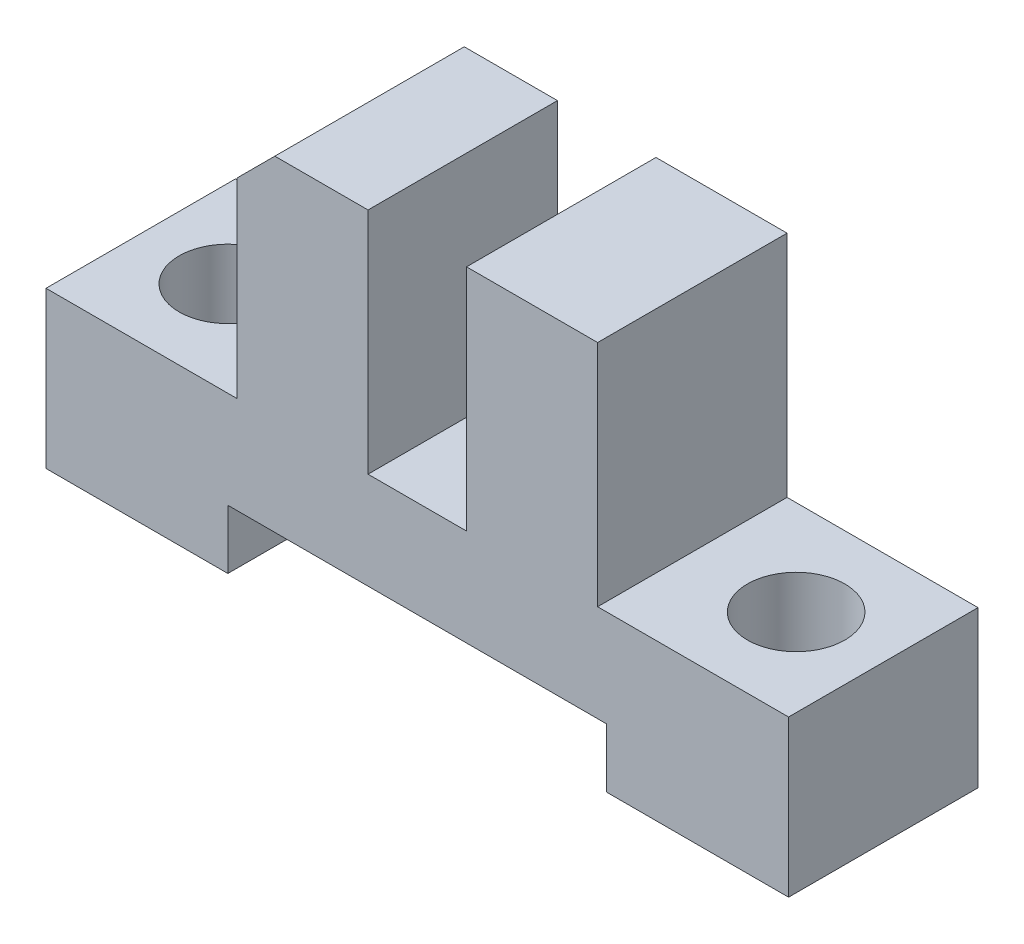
ISO-10303-21;
HEADER;
FILE_DESCRIPTION(('STEP AP214'),'2;1');
FILE_NAME('part.step','',(''),(''),'','','');
FILE_SCHEMA(('AUTOMOTIVE_DESIGN { 1 0 10303 214 1 1 1 1 }'));
ENDSEC;
DATA;
#1=APPLICATION_CONTEXT('core data for automotive mechanical design processes');
#2=APPLICATION_PROTOCOL_DEFINITION('international standard','automotive_design',2000,#1);
#3=PRODUCT_CONTEXT('',#1,'mechanical');
#4=PRODUCT('Part','Part','',(#3));
#5=PRODUCT_RELATED_PRODUCT_CATEGORY('part','',(#4));
#6=PRODUCT_DEFINITION_FORMATION('','',#4);
#7=PRODUCT_DEFINITION_CONTEXT('part definition',#1,'design');
#8=PRODUCT_DEFINITION('design','',#6,#7);
#9=PRODUCT_DEFINITION_SHAPE('','',#8);
#10=(LENGTH_UNIT() NAMED_UNIT(*) SI_UNIT(.MILLI.,.METRE.));
#11=(NAMED_UNIT(*) PLANE_ANGLE_UNIT() SI_UNIT($,.RADIAN.));
#12=(NAMED_UNIT(*) SI_UNIT($,.STERADIAN.) SOLID_ANGLE_UNIT());
#13=UNCERTAINTY_MEASURE_WITH_UNIT(LENGTH_MEASURE(1.E-05),#10,'distance_accuracy_value','');
#14=(GEOMETRIC_REPRESENTATION_CONTEXT(3) GLOBAL_UNCERTAINTY_ASSIGNED_CONTEXT((#13)) GLOBAL_UNIT_ASSIGNED_CONTEXT((#10,
#11,#12)) REPRESENTATION_CONTEXT('',''));
#15=CARTESIAN_POINT('',(0.,0.,0.));
#16=DIRECTION('',(0.,0.,1.));
#17=DIRECTION('',(1.,0.,0.));
#18=AXIS2_PLACEMENT_3D('',#15,#16,#17);
#19=CARTESIAN_POINT('',(-6.0452,12.9032,6.35));
#20=DIRECTION('',(1.,0.,0.));
#21=DIRECTION('',(0.,1.,0.));
#22=AXIS2_PLACEMENT_3D('',#19,#20,#21);
#23=PLANE('',#22);
#24=DIRECTION('',(0.,-1.,0.));
#25=VECTOR('',#24,1.);
#26=CARTESIAN_POINT('',(-6.0452,12.9032,6.35));
#27=LINE('',#26,#25);
#28=CARTESIAN_POINT('',(-6.0452,11.6332,6.35));
#29=VERTEX_POINT('',#28);
#30=CARTESIAN_POINT('',(-6.0452,5.2324,6.35));
#31=VERTEX_POINT('',#30);
#32=EDGE_CURVE('E241',#29,#31,#27,.T.);
#33=ORIENTED_EDGE('',*,*,#32,.F.);
#34=DIRECTION('',(0.,0.,-1.));
#35=VECTOR('',#34,1.);
#36=CARTESIAN_POINT('',(-6.0452,11.6332,6.35));
#37=LINE('',#36,#35);
#38=CARTESIAN_POINT('',(-6.0452,11.6332,0.));
#39=VERTEX_POINT('',#38);
#40=EDGE_CURVE('E152',#29,#39,#37,.T.);
#41=ORIENTED_EDGE('',*,*,#40,.T.);
#42=DIRECTION('',(0.,-1.,0.));
#43=VECTOR('',#42,1.);
#44=CARTESIAN_POINT('',(-6.0452,12.9032,0.));
#45=LINE('',#44,#43);
#46=CARTESIAN_POINT('',(-6.0452,5.2324,0.));
#47=VERTEX_POINT('',#46);
#48=EDGE_CURVE('E146',#39,#47,#45,.T.);
#49=ORIENTED_EDGE('',*,*,#48,.T.);
#50=DIRECTION('',(0.,0.,-1.));
#51=VECTOR('',#50,1.);
#52=CARTESIAN_POINT('',(-6.0452,5.2324,6.35));
#53=LINE('',#52,#51);
#54=EDGE_CURVE('E150',#31,#47,#53,.T.);
#55=ORIENTED_EDGE('',*,*,#54,.F.);
#56=EDGE_LOOP('',(#33,#41,#49,#55));
#57=FACE_BOUND('',#56,.T.);
#58=ADVANCED_FACE('F28',(#57),#23,.F.);
#59=CARTESIAN_POINT('',(-12.446,5.2324,6.35));
#60=DIRECTION('',(0.,-1.,0.));
#61=DIRECTION('',(0.,0.,-1.));
#62=AXIS2_PLACEMENT_3D('',#59,#60,#61);
#63=PLANE('',#62);
#64=CARTESIAN_POINT('',(-9.525,5.2324,3.175));
#65=DIRECTION('',(0.,1.,0.));
#66=DIRECTION('',(0.,0.,1.));
#67=AXIS2_PLACEMENT_3D('',#64,#65,#66);
#68=CIRCLE('',#67,1.63194999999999);
#69=CARTESIAN_POINT('',(-9.525,5.2324,4.80694999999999));
#70=VERTEX_POINT('',#69);
#71=EDGE_CURVE('E278',#70,#70,#68,.T.);
#72=ORIENTED_EDGE('',*,*,#71,.F.);
#73=EDGE_LOOP('',(#72));
#74=FACE_BOUND('',#73,.T.);
#75=DIRECTION('',(-1.,0.,0.));
#76=VECTOR('',#75,1.);
#77=CARTESIAN_POINT('',(-12.446,5.2324,0.));
#78=LINE('',#77,#76);
#79=CARTESIAN_POINT('',(-12.446,5.2324,0.));
#80=VERTEX_POINT('',#79);
#81=EDGE_CURVE('E153',#47,#80,#78,.T.);
#82=ORIENTED_EDGE('',*,*,#81,.T.);
#83=DIRECTION('',(0.,0.,-1.));
#84=VECTOR('',#83,1.);
#85=CARTESIAN_POINT('',(-12.446,5.2324,6.35));
#86=LINE('',#85,#84);
#87=CARTESIAN_POINT('',(-12.446,5.2324,6.35));
#88=VERTEX_POINT('',#87);
#89=EDGE_CURVE('E167',#88,#80,#86,.T.);
#90=ORIENTED_EDGE('',*,*,#89,.F.);
#91=DIRECTION('',(-1.,0.,0.));
#92=VECTOR('',#91,1.);
#93=CARTESIAN_POINT('',(-12.446,5.2324,6.35));
#94=LINE('',#93,#92);
#95=EDGE_CURVE('E166',#31,#88,#94,.T.);
#96=ORIENTED_EDGE('',*,*,#95,.F.);
#97=ORIENTED_EDGE('',*,*,#54,.T.);
#98=EDGE_LOOP('',(#82,#90,#96,#97));
#99=FACE_BOUND('',#98,.T.);
#100=ADVANCED_FACE('F165',(#74,#99),#63,.F.);
#101=CARTESIAN_POINT('',(-12.446,0.,6.35));
#102=DIRECTION('',(1.,0.,0.));
#103=DIRECTION('',(0.,0.,-1.));
#104=AXIS2_PLACEMENT_3D('',#101,#102,#103);
#105=PLANE('',#104);
#106=DIRECTION('',(0.,-1.,0.));
#107=VECTOR('',#106,1.);
#108=CARTESIAN_POINT('',(-12.446,0.,0.));
#109=LINE('',#108,#107);
#110=CARTESIAN_POINT('',(-12.446,0.,0.));
#111=VERTEX_POINT('',#110);
#112=EDGE_CURVE('E159',#80,#111,#109,.T.);
#113=ORIENTED_EDGE('',*,*,#112,.T.);
#114=DIRECTION('',(0.,0.,-1.));
#115=VECTOR('',#114,1.);
#116=CARTESIAN_POINT('',(-12.446,0.,6.35));
#117=LINE('',#116,#115);
#118=CARTESIAN_POINT('',(-12.446,0.,6.35));
#119=VERTEX_POINT('',#118);
#120=EDGE_CURVE('E170',#119,#111,#117,.T.);
#121=ORIENTED_EDGE('',*,*,#120,.F.);
#122=DIRECTION('',(0.,-1.,0.));
#123=VECTOR('',#122,1.);
#124=CARTESIAN_POINT('',(-12.446,0.,6.35));
#125=LINE('',#124,#123);
#126=EDGE_CURVE('E238',#88,#119,#125,.T.);
#127=ORIENTED_EDGE('',*,*,#126,.F.);
#128=ORIENTED_EDGE('',*,*,#89,.T.);
#129=EDGE_LOOP('',(#113,#121,#127,#128));
#130=FACE_BOUND('',#129,.T.);
#131=ADVANCED_FACE('F285',(#130),#105,.F.);
#132=CARTESIAN_POINT('',(-12.446,0.,6.35));
#133=DIRECTION('',(0.,1.,0.));
#134=DIRECTION('',(0.,0.,1.));
#135=AXIS2_PLACEMENT_3D('',#132,#133,#134);
#136=PLANE('',#135);
#137=CARTESIAN_POINT('',(-9.525,0.,3.175));
#138=DIRECTION('',(0.,1.,0.));
#139=DIRECTION('',(0.,0.,1.));
#140=AXIS2_PLACEMENT_3D('',#137,#138,#139);
#141=CIRCLE('',#140,1.63195);
#142=CARTESIAN_POINT('',(-9.525,0.,4.80695));
#143=VERTEX_POINT('',#142);
#144=EDGE_CURVE('E275',#143,#143,#141,.T.);
#145=ORIENTED_EDGE('',*,*,#144,.T.);
#146=EDGE_LOOP('',(#145));
#147=FACE_BOUND('',#146,.T.);
#148=DIRECTION('',(1.,0.,0.));
#149=VECTOR('',#148,1.);
#150=CARTESIAN_POINT('',(-12.446,0.,0.));
#151=LINE('',#150,#149);
#152=CARTESIAN_POINT('',(-6.35,0.,0.));
#153=VERTEX_POINT('',#152);
#154=EDGE_CURVE('E267',#111,#153,#151,.T.);
#155=ORIENTED_EDGE('',*,*,#154,.T.);
#156=DIRECTION('',(0.,0.,-1.));
#157=VECTOR('',#156,1.);
#158=CARTESIAN_POINT('',(-6.35,0.,6.35));
#159=LINE('',#158,#157);
#160=CARTESIAN_POINT('',(-6.35,0.,6.35));
#161=VERTEX_POINT('',#160);
#162=EDGE_CURVE('E176',#161,#153,#159,.T.);
#163=ORIENTED_EDGE('',*,*,#162,.F.);
#164=DIRECTION('',(1.,0.,0.));
#165=VECTOR('',#164,1.);
#166=CARTESIAN_POINT('',(-12.446,0.,6.35));
#167=LINE('',#166,#165);
#168=EDGE_CURVE('E236',#119,#161,#167,.T.);
#169=ORIENTED_EDGE('',*,*,#168,.F.);
#170=ORIENTED_EDGE('',*,*,#120,.T.);
#171=EDGE_LOOP('',(#155,#163,#169,#170));
#172=FACE_BOUND('',#171,.T.);
#173=ADVANCED_FACE('F290',(#147,#172),#136,.F.);
#174=CARTESIAN_POINT('',(-6.35,0.,6.35));
#175=DIRECTION('',(-1.,0.,0.));
#176=DIRECTION('',(0.,0.,1.));
#177=AXIS2_PLACEMENT_3D('',#174,#175,#176);
#178=PLANE('',#177);
#179=DIRECTION('',(0.,1.,0.));
#180=VECTOR('',#179,1.);
#181=CARTESIAN_POINT('',(-6.35,0.,0.));
#182=LINE('',#181,#180);
#183=CARTESIAN_POINT('',(-6.35,1.9812,0.));
#184=VERTEX_POINT('',#183);
#185=EDGE_CURVE('E265',#153,#184,#182,.T.);
#186=ORIENTED_EDGE('',*,*,#185,.T.);
#187=DIRECTION('',(0.,0.,-1.));
#188=VECTOR('',#187,1.);
#189=CARTESIAN_POINT('',(-6.35,1.9812,6.35));
#190=LINE('',#189,#188);
#191=CARTESIAN_POINT('',(-6.35,1.9812,6.35));
#192=VERTEX_POINT('',#191);
#193=EDGE_CURVE('E179',#192,#184,#190,.T.);
#194=ORIENTED_EDGE('',*,*,#193,.F.);
#195=DIRECTION('',(0.,1.,0.));
#196=VECTOR('',#195,1.);
#197=CARTESIAN_POINT('',(-6.35,0.,6.35));
#198=LINE('',#197,#196);
#199=EDGE_CURVE('E234',#161,#192,#198,.T.);
#200=ORIENTED_EDGE('',*,*,#199,.F.);
#201=ORIENTED_EDGE('',*,*,#162,.T.);
#202=EDGE_LOOP('',(#186,#194,#200,#201));
#203=FACE_BOUND('',#202,.T.);
#204=ADVANCED_FACE('F296',(#203),#178,.F.);
#205=CARTESIAN_POINT('',(-6.35,1.9812,6.35));
#206=DIRECTION('',(0.,1.,0.));
#207=DIRECTION('',(0.,0.,1.));
#208=AXIS2_PLACEMENT_3D('',#205,#206,#207);
#209=PLANE('',#208);
#210=DIRECTION('',(1.,0.,0.));
#211=VECTOR('',#210,1.);
#212=CARTESIAN_POINT('',(-6.35,1.9812,0.));
#213=LINE('',#212,#211);
#214=CARTESIAN_POINT('',(6.35,1.9812,0.));
#215=VERTEX_POINT('',#214);
#216=EDGE_CURVE('E263',#184,#215,#213,.T.);
#217=ORIENTED_EDGE('',*,*,#216,.T.);
#218=DIRECTION('',(0.,0.,-1.));
#219=VECTOR('',#218,1.);
#220=CARTESIAN_POINT('',(6.35,1.9812,6.35));
#221=LINE('',#220,#219);
#222=CARTESIAN_POINT('',(6.35,1.9812,6.35));
#223=VERTEX_POINT('',#222);
#224=EDGE_CURVE('E182',#223,#215,#221,.T.);
#225=ORIENTED_EDGE('',*,*,#224,.F.);
#226=DIRECTION('',(1.,0.,0.));
#227=VECTOR('',#226,1.);
#228=CARTESIAN_POINT('',(-6.35,1.9812,6.35));
#229=LINE('',#228,#227);
#230=EDGE_CURVE('E232',#192,#223,#229,.T.);
#231=ORIENTED_EDGE('',*,*,#230,.F.);
#232=ORIENTED_EDGE('',*,*,#193,.T.);
#233=EDGE_LOOP('',(#217,#225,#231,#232));
#234=FACE_BOUND('',#233,.T.);
#235=ADVANCED_FACE('F300',(#234),#209,.F.);
#236=CARTESIAN_POINT('',(6.35,1.9812,6.35));
#237=DIRECTION('',(1.,0.,0.));
#238=DIRECTION('',(0.,0.,-1.));
#239=AXIS2_PLACEMENT_3D('',#236,#237,#238);
#240=PLANE('',#239);
#241=DIRECTION('',(0.,-1.,0.));
#242=VECTOR('',#241,1.);
#243=CARTESIAN_POINT('',(6.35,1.9812,0.));
#244=LINE('',#243,#242);
#245=CARTESIAN_POINT('',(6.35,0.,0.));
#246=VERTEX_POINT('',#245);
#247=EDGE_CURVE('E261',#215,#246,#244,.T.);
#248=ORIENTED_EDGE('',*,*,#247,.T.);
#249=DIRECTION('',(0.,0.,-1.));
#250=VECTOR('',#249,1.);
#251=CARTESIAN_POINT('',(6.35,0.,6.35));
#252=LINE('',#251,#250);
#253=CARTESIAN_POINT('',(6.35,0.,6.35));
#254=VERTEX_POINT('',#253);
#255=EDGE_CURVE('E185',#254,#246,#252,.T.);
#256=ORIENTED_EDGE('',*,*,#255,.F.);
#257=DIRECTION('',(0.,-1.,0.));
#258=VECTOR('',#257,1.);
#259=CARTESIAN_POINT('',(6.35,1.9812,6.35));
#260=LINE('',#259,#258);
#261=EDGE_CURVE('E230',#223,#254,#260,.T.);
#262=ORIENTED_EDGE('',*,*,#261,.F.);
#263=ORIENTED_EDGE('',*,*,#224,.T.);
#264=EDGE_LOOP('',(#248,#256,#262,#263));
#265=FACE_BOUND('',#264,.T.);
#266=ADVANCED_FACE('F304',(#265),#240,.F.);
#267=CARTESIAN_POINT('',(6.35,0.,6.35));
#268=DIRECTION('',(0.,1.,0.));
#269=DIRECTION('',(0.,0.,1.));
#270=AXIS2_PLACEMENT_3D('',#267,#268,#269);
#271=PLANE('',#270);
#272=CARTESIAN_POINT('',(9.525,0.,3.175));
#273=DIRECTION('',(0.,1.,0.));
#274=DIRECTION('',(0.,0.,1.));
#275=AXIS2_PLACEMENT_3D('',#272,#273,#274);
#276=CIRCLE('',#275,1.63195);
#277=CARTESIAN_POINT('',(9.525,0.,4.80695));
#278=VERTEX_POINT('',#277);
#279=EDGE_CURVE('E154',#278,#278,#276,.T.);
#280=ORIENTED_EDGE('',*,*,#279,.T.);
#281=EDGE_LOOP('',(#280));
#282=FACE_BOUND('',#281,.T.);
#283=DIRECTION('',(1.,0.,0.));
#284=VECTOR('',#283,1.);
#285=CARTESIAN_POINT('',(6.35,0.,0.));
#286=LINE('',#285,#284);
#287=CARTESIAN_POINT('',(12.446,0.,0.));
#288=VERTEX_POINT('',#287);
#289=EDGE_CURVE('E259',#246,#288,#286,.T.);
#290=ORIENTED_EDGE('',*,*,#289,.T.);
#291=DIRECTION('',(0.,0.,-1.));
#292=VECTOR('',#291,1.);
#293=CARTESIAN_POINT('',(12.446,0.,6.35));
#294=LINE('',#293,#292);
#295=CARTESIAN_POINT('',(12.446,0.,6.35));
#296=VERTEX_POINT('',#295);
#297=EDGE_CURVE('E188',#296,#288,#294,.T.);
#298=ORIENTED_EDGE('',*,*,#297,.F.);
#299=DIRECTION('',(1.,0.,0.));
#300=VECTOR('',#299,1.);
#301=CARTESIAN_POINT('',(6.35,0.,6.35));
#302=LINE('',#301,#300);
#303=EDGE_CURVE('E228',#254,#296,#302,.T.);
#304=ORIENTED_EDGE('',*,*,#303,.F.);
#305=ORIENTED_EDGE('',*,*,#255,.T.);
#306=EDGE_LOOP('',(#290,#298,#304,#305));
#307=FACE_BOUND('',#306,.T.);
#308=ADVANCED_FACE('F308',(#282,#307),#271,.F.);
#309=CARTESIAN_POINT('',(12.446,0.,6.35));
#310=DIRECTION('',(-1.,0.,0.));
#311=DIRECTION('',(0.,0.,1.));
#312=AXIS2_PLACEMENT_3D('',#309,#310,#311);
#313=PLANE('',#312);
#314=DIRECTION('',(0.,1.,0.));
#315=VECTOR('',#314,1.);
#316=CARTESIAN_POINT('',(12.446,0.,0.));
#317=LINE('',#316,#315);
#318=CARTESIAN_POINT('',(12.446,5.2324,0.));
#319=VERTEX_POINT('',#318);
#320=EDGE_CURVE('E257',#288,#319,#317,.T.);
#321=ORIENTED_EDGE('',*,*,#320,.T.);
#322=DIRECTION('',(0.,0.,-1.));
#323=VECTOR('',#322,1.);
#324=CARTESIAN_POINT('',(12.446,5.2324,6.35));
#325=LINE('',#324,#323);
#326=CARTESIAN_POINT('',(12.446,5.2324,6.35));
#327=VERTEX_POINT('',#326);
#328=EDGE_CURVE('E191',#327,#319,#325,.T.);
#329=ORIENTED_EDGE('',*,*,#328,.F.);
#330=DIRECTION('',(0.,1.,0.));
#331=VECTOR('',#330,1.);
#332=CARTESIAN_POINT('',(12.446,0.,6.35));
#333=LINE('',#332,#331);
#334=EDGE_CURVE('E226',#296,#327,#333,.T.);
#335=ORIENTED_EDGE('',*,*,#334,.F.);
#336=ORIENTED_EDGE('',*,*,#297,.T.);
#337=EDGE_LOOP('',(#321,#329,#335,#336));
#338=FACE_BOUND('',#337,.T.);
#339=ADVANCED_FACE('F312',(#338),#313,.F.);
#340=CARTESIAN_POINT('',(6.0452,5.2324,6.35));
#341=DIRECTION('',(0.,-1.,0.));
#342=DIRECTION('',(0.,0.,-1.));
#343=AXIS2_PLACEMENT_3D('',#340,#341,#342);
#344=PLANE('',#343);
#345=CARTESIAN_POINT('',(9.525,5.2324,3.175));
#346=DIRECTION('',(0.,1.,0.));
#347=DIRECTION('',(0.,0.,1.));
#348=AXIS2_PLACEMENT_3D('',#345,#346,#347);
#349=CIRCLE('',#348,1.63194999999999);
#350=CARTESIAN_POINT('',(9.525,5.2324,4.80694999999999));
#351=VERTEX_POINT('',#350);
#352=EDGE_CURVE('E272',#351,#351,#349,.T.);
#353=ORIENTED_EDGE('',*,*,#352,.F.);
#354=EDGE_LOOP('',(#353));
#355=FACE_BOUND('',#354,.T.);
#356=DIRECTION('',(-1.,0.,0.));
#357=VECTOR('',#356,1.);
#358=CARTESIAN_POINT('',(6.0452,5.2324,0.));
#359=LINE('',#358,#357);
#360=CARTESIAN_POINT('',(6.0452,5.2324,0.));
#361=VERTEX_POINT('',#360);
#362=EDGE_CURVE('E255',#319,#361,#359,.T.);
#363=ORIENTED_EDGE('',*,*,#362,.T.);
#364=DIRECTION('',(0.,0.,-1.));
#365=VECTOR('',#364,1.);
#366=CARTESIAN_POINT('',(6.0452,5.2324,6.35));
#367=LINE('',#366,#365);
#368=CARTESIAN_POINT('',(6.0452,5.2324,6.35));
#369=VERTEX_POINT('',#368);
#370=EDGE_CURVE('E194',#369,#361,#367,.T.);
#371=ORIENTED_EDGE('',*,*,#370,.F.);
#372=DIRECTION('',(-1.,0.,0.));
#373=VECTOR('',#372,1.);
#374=CARTESIAN_POINT('',(6.0452,5.2324,6.35));
#375=LINE('',#374,#373);
#376=EDGE_CURVE('E224',#327,#369,#375,.T.);
#377=ORIENTED_EDGE('',*,*,#376,.F.);
#378=ORIENTED_EDGE('',*,*,#328,.T.);
#379=EDGE_LOOP('',(#363,#371,#377,#378));
#380=FACE_BOUND('',#379,.T.);
#381=ADVANCED_FACE('F316',(#355,#380),#344,.F.);
#382=CARTESIAN_POINT('',(6.0452,12.9032,6.35));
#383=DIRECTION('',(-1.,0.,0.));
#384=DIRECTION('',(0.,-1.,0.));
#385=AXIS2_PLACEMENT_3D('',#382,#383,#384);
#386=PLANE('',#385);
#387=DIRECTION('',(0.,1.,0.));
#388=VECTOR('',#387,1.);
#389=CARTESIAN_POINT('',(6.0452,12.9032,0.));
#390=LINE('',#389,#388);
#391=CARTESIAN_POINT('',(6.0452,12.9032,0.));
#392=VERTEX_POINT('',#391);
#393=EDGE_CURVE('E253',#361,#392,#390,.T.);
#394=ORIENTED_EDGE('',*,*,#393,.T.);
#395=DIRECTION('',(0.,0.,-1.));
#396=VECTOR('',#395,1.);
#397=CARTESIAN_POINT('',(6.0452,12.9032,6.35));
#398=LINE('',#397,#396);
#399=CARTESIAN_POINT('',(6.0452,12.9032,6.35));
#400=VERTEX_POINT('',#399);
#401=EDGE_CURVE('E197',#400,#392,#398,.T.);
#402=ORIENTED_EDGE('',*,*,#401,.F.);
#403=DIRECTION('',(0.,1.,0.));
#404=VECTOR('',#403,1.);
#405=CARTESIAN_POINT('',(6.0452,12.9032,6.35));
#406=LINE('',#405,#404);
#407=EDGE_CURVE('E222',#369,#400,#406,.T.);
#408=ORIENTED_EDGE('',*,*,#407,.F.);
#409=ORIENTED_EDGE('',*,*,#370,.T.);
#410=EDGE_LOOP('',(#394,#402,#408,#409));
#411=FACE_BOUND('',#410,.T.);
#412=ADVANCED_FACE('F320',(#411),#386,.F.);
#413=CARTESIAN_POINT('',(1.651,12.9032,6.35));
#414=DIRECTION('',(0.,-1.,0.));
#415=DIRECTION('',(0.,0.,-1.));
#416=AXIS2_PLACEMENT_3D('',#413,#414,#415);
#417=PLANE('',#416);
#418=DIRECTION('',(-1.,0.,0.));
#419=VECTOR('',#418,1.);
#420=CARTESIAN_POINT('',(1.651,12.9032,0.));
#421=LINE('',#420,#419);
#422=CARTESIAN_POINT('',(1.651,12.9032,0.));
#423=VERTEX_POINT('',#422);
#424=EDGE_CURVE('E251',#392,#423,#421,.T.);
#425=ORIENTED_EDGE('',*,*,#424,.T.);
#426=DIRECTION('',(0.,0.,-1.));
#427=VECTOR('',#426,1.);
#428=CARTESIAN_POINT('',(1.651,12.9032,6.35));
#429=LINE('',#428,#427);
#430=CARTESIAN_POINT('',(1.651,12.9032,6.35));
#431=VERTEX_POINT('',#430);
#432=EDGE_CURVE('E200',#431,#423,#429,.T.);
#433=ORIENTED_EDGE('',*,*,#432,.F.);
#434=DIRECTION('',(-1.,0.,0.));
#435=VECTOR('',#434,1.);
#436=CARTESIAN_POINT('',(1.651,12.9032,6.35));
#437=LINE('',#436,#435);
#438=EDGE_CURVE('E220',#400,#431,#437,.T.);
#439=ORIENTED_EDGE('',*,*,#438,.F.);
#440=ORIENTED_EDGE('',*,*,#401,.T.);
#441=EDGE_LOOP('',(#425,#433,#439,#440));
#442=FACE_BOUND('',#441,.T.);
#443=ADVANCED_FACE('F324',(#442),#417,.F.);
#444=CARTESIAN_POINT('',(1.651,12.9032,6.35));
#445=DIRECTION('',(1.,0.,0.));
#446=DIRECTION('',(0.,0.,-1.));
#447=AXIS2_PLACEMENT_3D('',#444,#445,#446);
#448=PLANE('',#447);
#449=DIRECTION('',(0.,-1.,0.));
#450=VECTOR('',#449,1.);
#451=CARTESIAN_POINT('',(1.651,12.9032,0.));
#452=LINE('',#451,#450);
#453=CARTESIAN_POINT('',(1.651,5.2324,0.));
#454=VERTEX_POINT('',#453);
#455=EDGE_CURVE('E249',#423,#454,#452,.T.);
#456=ORIENTED_EDGE('',*,*,#455,.T.);
#457=DIRECTION('',(0.,0.,-1.));
#458=VECTOR('',#457,1.);
#459=CARTESIAN_POINT('',(1.651,5.2324,6.35));
#460=LINE('',#459,#458);
#461=CARTESIAN_POINT('',(1.651,5.2324,6.35));
#462=VERTEX_POINT('',#461);
#463=EDGE_CURVE('E203',#462,#454,#460,.T.);
#464=ORIENTED_EDGE('',*,*,#463,.F.);
#465=DIRECTION('',(0.,-1.,0.));
#466=VECTOR('',#465,1.);
#467=CARTESIAN_POINT('',(1.651,12.9032,6.35));
#468=LINE('',#467,#466);
#469=EDGE_CURVE('E218',#431,#462,#468,.T.);
#470=ORIENTED_EDGE('',*,*,#469,.F.);
#471=ORIENTED_EDGE('',*,*,#432,.T.);
#472=EDGE_LOOP('',(#456,#464,#470,#471));
#473=FACE_BOUND('',#472,.T.);
#474=ADVANCED_FACE('F328',(#473),#448,.F.);
#475=CARTESIAN_POINT('',(1.651,5.2324,6.35));
#476=DIRECTION('',(0.,-1.,0.));
#477=DIRECTION('',(0.,0.,-1.));
#478=AXIS2_PLACEMENT_3D('',#475,#476,#477);
#479=PLANE('',#478);
#480=DIRECTION('',(-1.,0.,0.));
#481=VECTOR('',#480,1.);
#482=CARTESIAN_POINT('',(1.651,5.2324,0.));
#483=LINE('',#482,#481);
#484=CARTESIAN_POINT('',(-1.651,5.2324,0.));
#485=VERTEX_POINT('',#484);
#486=EDGE_CURVE('E247',#454,#485,#483,.T.);
#487=ORIENTED_EDGE('',*,*,#486,.T.);
#488=DIRECTION('',(0.,0.,-1.));
#489=VECTOR('',#488,1.);
#490=CARTESIAN_POINT('',(-1.651,5.2324,6.35));
#491=LINE('',#490,#489);
#492=CARTESIAN_POINT('',(-1.651,5.2324,6.35));
#493=VERTEX_POINT('',#492);
#494=EDGE_CURVE('E206',#493,#485,#491,.T.);
#495=ORIENTED_EDGE('',*,*,#494,.F.);
#496=DIRECTION('',(-1.,0.,0.));
#497=VECTOR('',#496,1.);
#498=CARTESIAN_POINT('',(1.651,5.2324,6.35));
#499=LINE('',#498,#497);
#500=EDGE_CURVE('E216',#462,#493,#499,.T.);
#501=ORIENTED_EDGE('',*,*,#500,.F.);
#502=ORIENTED_EDGE('',*,*,#463,.T.);
#503=EDGE_LOOP('',(#487,#495,#501,#502));
#504=FACE_BOUND('',#503,.T.);
#505=ADVANCED_FACE('F332',(#504),#479,.F.);
#506=CARTESIAN_POINT('',(-1.651,5.2324,6.35));
#507=DIRECTION('',(-1.,0.,0.));
#508=DIRECTION('',(0.,0.,1.));
#509=AXIS2_PLACEMENT_3D('',#506,#507,#508);
#510=PLANE('',#509);
#511=DIRECTION('',(0.,1.,0.));
#512=VECTOR('',#511,1.);
#513=CARTESIAN_POINT('',(-1.651,5.2324,0.));
#514=LINE('',#513,#512);
#515=CARTESIAN_POINT('',(-1.651,12.9032,0.));
#516=VERTEX_POINT('',#515);
#517=EDGE_CURVE('E245',#485,#516,#514,.T.);
#518=ORIENTED_EDGE('',*,*,#517,.T.);
#519=DIRECTION('',(0.,0.,-1.));
#520=VECTOR('',#519,1.);
#521=CARTESIAN_POINT('',(-1.651,12.9032,6.35));
#522=LINE('',#521,#520);
#523=CARTESIAN_POINT('',(-1.651,12.9032,6.35));
#524=VERTEX_POINT('',#523);
#525=EDGE_CURVE('E209',#524,#516,#522,.T.);
#526=ORIENTED_EDGE('',*,*,#525,.F.);
#527=DIRECTION('',(0.,1.,0.));
#528=VECTOR('',#527,1.);
#529=CARTESIAN_POINT('',(-1.651,5.2324,6.35));
#530=LINE('',#529,#528);
#531=EDGE_CURVE('E214',#493,#524,#530,.T.);
#532=ORIENTED_EDGE('',*,*,#531,.F.);
#533=ORIENTED_EDGE('',*,*,#494,.T.);
#534=EDGE_LOOP('',(#518,#526,#532,#533));
#535=FACE_BOUND('',#534,.T.);
#536=ADVANCED_FACE('F336',(#535),#510,.F.);
#537=CARTESIAN_POINT('',(-6.0452,12.9032,6.35));
#538=DIRECTION('',(0.,-1.,0.));
#539=DIRECTION('',(0.,0.,-1.));
#540=AXIS2_PLACEMENT_3D('',#537,#538,#539);
#541=PLANE('',#540);
#542=DIRECTION('',(-1.,0.,0.));
#543=VECTOR('',#542,1.);
#544=CARTESIAN_POINT('',(-6.0452,12.9032,0.));
#545=LINE('',#544,#543);
#546=CARTESIAN_POINT('',(-4.77519999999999,12.9032,0.));
#547=VERTEX_POINT('',#546);
#548=EDGE_CURVE('E243',#516,#547,#545,.T.);
#549=ORIENTED_EDGE('',*,*,#548,.T.);
#550=DIRECTION('',(0.,0.,1.));
#551=VECTOR('',#550,1.);
#552=CARTESIAN_POINT('',(-4.77519999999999,12.9032,6.35));
#553=LINE('',#552,#551);
#554=CARTESIAN_POINT('',(-4.77519999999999,12.9032,6.35));
#555=VERTEX_POINT('',#554);
#556=EDGE_CURVE('E35',#547,#555,#553,.T.);
#557=ORIENTED_EDGE('',*,*,#556,.T.);
#558=DIRECTION('',(-1.,0.,0.));
#559=VECTOR('',#558,1.);
#560=CARTESIAN_POINT('',(-6.0452,12.9032,6.35));
#561=LINE('',#560,#559);
#562=EDGE_CURVE('E212',#524,#555,#561,.T.);
#563=ORIENTED_EDGE('',*,*,#562,.F.);
#564=ORIENTED_EDGE('',*,*,#525,.T.);
#565=EDGE_LOOP('',(#549,#557,#563,#564));
#566=FACE_BOUND('',#565,.T.);
#567=ADVANCED_FACE('F340',(#566),#541,.F.);
#568=CARTESIAN_POINT('',(-6.0452,0.,6.35));
#569=DIRECTION('',(0.,0.,1.));
#570=DIRECTION('',(1.,0.,0.));
#571=AXIS2_PLACEMENT_3D('',#568,#569,#570);
#572=PLANE('',#571);
#573=ORIENTED_EDGE('',*,*,#562,.T.);
#574=DIRECTION('',(0.707106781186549,0.707106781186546,0.));
#575=VECTOR('',#574,1.);
#576=CARTESIAN_POINT('',(-11.8618,5.81660000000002,6.35));
#577=LINE('',#576,#575);
#578=EDGE_CURVE('E11',#555,#29,#577,.F.);
#579=ORIENTED_EDGE('',*,*,#578,.T.);
#580=ORIENTED_EDGE('',*,*,#32,.T.);
#581=ORIENTED_EDGE('',*,*,#95,.T.);
#582=ORIENTED_EDGE('',*,*,#126,.T.);
#583=ORIENTED_EDGE('',*,*,#168,.T.);
#584=ORIENTED_EDGE('',*,*,#199,.T.);
#585=ORIENTED_EDGE('',*,*,#230,.T.);
#586=ORIENTED_EDGE('',*,*,#261,.T.);
#587=ORIENTED_EDGE('',*,*,#303,.T.);
#588=ORIENTED_EDGE('',*,*,#334,.T.);
#589=ORIENTED_EDGE('',*,*,#376,.T.);
#590=ORIENTED_EDGE('',*,*,#407,.T.);
#591=ORIENTED_EDGE('',*,*,#438,.T.);
#592=ORIENTED_EDGE('',*,*,#469,.T.);
#593=ORIENTED_EDGE('',*,*,#500,.T.);
#594=ORIENTED_EDGE('',*,*,#531,.T.);
#595=EDGE_LOOP('',(#573,#579,#580,#581,#582,#583,#584,#585,#586,#587,#588,#589,#590,#591,#592,
#593,#594));
#596=FACE_BOUND('',#595,.T.);
#597=ADVANCED_FACE('F344',(#596),#572,.T.);
#598=CARTESIAN_POINT('',(-6.0452,0.,0.));
#599=DIRECTION('',(0.,0.,1.));
#600=DIRECTION('',(1.,0.,0.));
#601=AXIS2_PLACEMENT_3D('',#598,#599,#600);
#602=PLANE('',#601);
#603=ORIENTED_EDGE('',*,*,#48,.F.);
#604=DIRECTION('',(-0.707106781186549,-0.707106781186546,0.));
#605=VECTOR('',#604,1.);
#606=CARTESIAN_POINT('',(-6.0452,11.6332,0.));
#607=LINE('',#606,#605);
#608=EDGE_CURVE('E49',#39,#547,#607,.F.);
#609=ORIENTED_EDGE('',*,*,#608,.T.);
#610=ORIENTED_EDGE('',*,*,#548,.F.);
#611=ORIENTED_EDGE('',*,*,#517,.F.);
#612=ORIENTED_EDGE('',*,*,#486,.F.);
#613=ORIENTED_EDGE('',*,*,#455,.F.);
#614=ORIENTED_EDGE('',*,*,#424,.F.);
#615=ORIENTED_EDGE('',*,*,#393,.F.);
#616=ORIENTED_EDGE('',*,*,#362,.F.);
#617=ORIENTED_EDGE('',*,*,#320,.F.);
#618=ORIENTED_EDGE('',*,*,#289,.F.);
#619=ORIENTED_EDGE('',*,*,#247,.F.);
#620=ORIENTED_EDGE('',*,*,#216,.F.);
#621=ORIENTED_EDGE('',*,*,#185,.F.);
#622=ORIENTED_EDGE('',*,*,#154,.F.);
#623=ORIENTED_EDGE('',*,*,#112,.F.);
#624=ORIENTED_EDGE('',*,*,#81,.F.);
#625=EDGE_LOOP('',(#603,#609,#610,#611,#612,#613,#614,#615,#616,#617,#618,#619,#620,#621,#622,
#623,#624));
#626=FACE_BOUND('',#625,.T.);
#627=ADVANCED_FACE('F157',(#626),#602,.F.);
#628=CARTESIAN_POINT('',(-6.0452,11.6332,6.35));
#629=DIRECTION('',(0.707106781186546,-0.707106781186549,0.));
#630=DIRECTION('',(0.707106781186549,0.707106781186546,0.));
#631=AXIS2_PLACEMENT_3D('',#628,#629,#630);
#632=PLANE('',#631);
#633=ORIENTED_EDGE('',*,*,#578,.F.);
#634=ORIENTED_EDGE('',*,*,#556,.F.);
#635=ORIENTED_EDGE('',*,*,#608,.F.);
#636=ORIENTED_EDGE('',*,*,#40,.F.);
#637=EDGE_LOOP('',(#633,#634,#635,#636));
#638=FACE_BOUND('',#637,.T.);
#639=ADVANCED_FACE('F350',(#638),#632,.F.);
#640=CARTESIAN_POINT('',(9.525,5.2324,3.175));
#641=DIRECTION('',(0.,1.,0.));
#642=DIRECTION('',(0.,0.,1.));
#643=AXIS2_PLACEMENT_3D('',#640,#641,#642);
#644=CYLINDRICAL_SURFACE('',#643,1.63194999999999);
#645=ORIENTED_EDGE('',*,*,#279,.F.);
#646=EDGE_LOOP('',(#645));
#647=FACE_BOUND('',#646,.T.);
#648=ORIENTED_EDGE('',*,*,#352,.T.);
#649=EDGE_LOOP('',(#648));
#650=FACE_BOUND('',#649,.T.);
#651=ADVANCED_FACE('F353',(#647,#650),#644,.F.);
#652=CARTESIAN_POINT('',(-9.525,5.2324,3.175));
#653=DIRECTION('',(0.,1.,0.));
#654=DIRECTION('',(0.,0.,1.));
#655=AXIS2_PLACEMENT_3D('',#652,#653,#654);
#656=CYLINDRICAL_SURFACE('',#655,1.63194999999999);
#657=ORIENTED_EDGE('',*,*,#144,.F.);
#658=EDGE_LOOP('',(#657));
#659=FACE_BOUND('',#658,.T.);
#660=ORIENTED_EDGE('',*,*,#71,.T.);
#661=EDGE_LOOP('',(#660));
#662=FACE_BOUND('',#661,.T.);
#663=ADVANCED_FACE('F282',(#659,#662),#656,.F.);
#664=CLOSED_SHELL('',(#58,#100,#131,#173,#204,#235,#266,#308,#339,#381,#412,#443,#474,#505,#536,
#567,#597,#627,#639,#651,#663));
#665=MANIFOLD_SOLID_BREP('B2',#664);
#666=ADVANCED_BREP_SHAPE_REPRESENTATION('',(#18,#665),#14);
#667=SHAPE_DEFINITION_REPRESENTATION(#9,#666);
ENDSEC;
END-ISO-10303-21;
